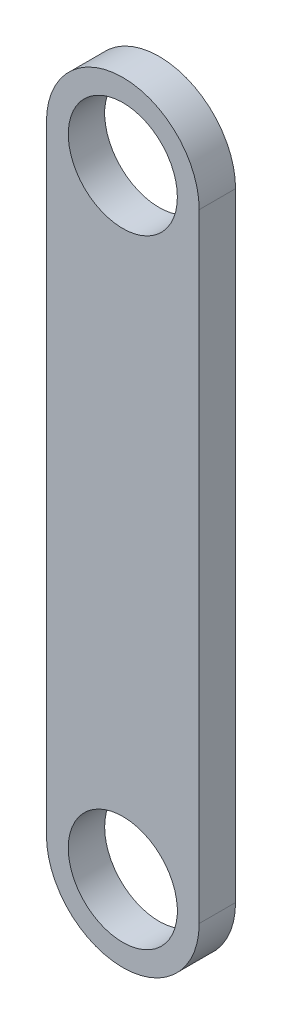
ISO-10303-21;
HEADER;
FILE_DESCRIPTION(('STEP AP214'),'2;1');
FILE_NAME('part.step','',(''),(''),'','','');
FILE_SCHEMA(('AUTOMOTIVE_DESIGN { 1 0 10303 214 1 1 1 1 }'));
ENDSEC;
DATA;
#1=APPLICATION_CONTEXT('core data for automotive mechanical design processes');
#2=APPLICATION_PROTOCOL_DEFINITION('international standard','automotive_design',2000,#1);
#3=PRODUCT_CONTEXT('',#1,'mechanical');
#4=PRODUCT('Part','Part','',(#3));
#5=PRODUCT_RELATED_PRODUCT_CATEGORY('part','',(#4));
#6=PRODUCT_DEFINITION_FORMATION('','',#4);
#7=PRODUCT_DEFINITION_CONTEXT('part definition',#1,'design');
#8=PRODUCT_DEFINITION('design','',#6,#7);
#9=PRODUCT_DEFINITION_SHAPE('','',#8);
#10=(LENGTH_UNIT() NAMED_UNIT(*) SI_UNIT(.MILLI.,.METRE.));
#11=(NAMED_UNIT(*) PLANE_ANGLE_UNIT() SI_UNIT($,.RADIAN.));
#12=(NAMED_UNIT(*) SI_UNIT($,.STERADIAN.) SOLID_ANGLE_UNIT());
#13=UNCERTAINTY_MEASURE_WITH_UNIT(LENGTH_MEASURE(1.E-05),#10,'distance_accuracy_value','');
#14=(GEOMETRIC_REPRESENTATION_CONTEXT(3) GLOBAL_UNCERTAINTY_ASSIGNED_CONTEXT((#13)) GLOBAL_UNIT_ASSIGNED_CONTEXT((#10,
#11,#12)) REPRESENTATION_CONTEXT('',''));
#15=CARTESIAN_POINT('',(0.,0.,0.));
#16=DIRECTION('',(0.,0.,1.));
#17=DIRECTION('',(1.,0.,0.));
#18=AXIS2_PLACEMENT_3D('',#15,#16,#17);
#19=CARTESIAN_POINT('',(0.,42.5,-5.));
#20=DIRECTION('',(0.,0.,1.));
#21=DIRECTION('',(1.,0.,0.));
#22=AXIS2_PLACEMENT_3D('',#19,#20,#21);
#23=CYLINDRICAL_SURFACE('',#22,10.5);
#24=CARTESIAN_POINT('',(0.,42.5,0.));
#25=DIRECTION('',(0.,0.,1.));
#26=DIRECTION('',(1.,0.,0.));
#27=AXIS2_PLACEMENT_3D('',#24,#25,#26);
#28=CIRCLE('',#27,10.5);
#29=CARTESIAN_POINT('',(10.5,42.5,0.));
#30=VERTEX_POINT('',#29);
#31=CARTESIAN_POINT('',(-10.5,42.5,0.));
#32=VERTEX_POINT('',#31);
#33=EDGE_CURVE('E98',#30,#32,#28,.T.);
#34=ORIENTED_EDGE('',*,*,#33,.F.);
#35=DIRECTION('',(0.,0.,1.));
#36=VECTOR('',#35,1.);
#37=CARTESIAN_POINT('',(10.5,42.5,-5.));
#38=LINE('',#37,#36);
#39=CARTESIAN_POINT('',(10.5,42.5,-5.));
#40=VERTEX_POINT('',#39);
#41=EDGE_CURVE('E11',#40,#30,#38,.T.);
#42=ORIENTED_EDGE('',*,*,#41,.F.);
#43=CARTESIAN_POINT('',(0.,42.5,-5.));
#44=DIRECTION('',(0.,0.,1.));
#45=DIRECTION('',(1.,0.,0.));
#46=AXIS2_PLACEMENT_3D('',#43,#44,#45);
#47=CIRCLE('',#46,10.5);
#48=CARTESIAN_POINT('',(-10.5,42.5,-5.));
#49=VERTEX_POINT('',#48);
#50=EDGE_CURVE('E91',#40,#49,#47,.T.);
#51=ORIENTED_EDGE('',*,*,#50,.T.);
#52=DIRECTION('',(0.,0.,1.));
#53=VECTOR('',#52,1.);
#54=CARTESIAN_POINT('',(-10.5,42.5,-5.));
#55=LINE('',#54,#53);
#56=EDGE_CURVE('E36',#49,#32,#55,.T.);
#57=ORIENTED_EDGE('',*,*,#56,.T.);
#58=EDGE_LOOP('',(#34,#42,#51,#57));
#59=FACE_BOUND('',#58,.T.);
#60=ADVANCED_FACE('F33',(#59),#23,.T.);
#61=CARTESIAN_POINT('',(10.5,42.5,-5.));
#62=DIRECTION('',(1.,0.,0.));
#63=DIRECTION('',(0.,1.,0.));
#64=AXIS2_PLACEMENT_3D('',#61,#62,#63);
#65=PLANE('',#64);
#66=DIRECTION('',(0.,1.,0.));
#67=VECTOR('',#66,1.);
#68=CARTESIAN_POINT('',(10.5,42.5,0.));
#69=LINE('',#68,#67);
#70=CARTESIAN_POINT('',(10.5,-42.5,0.));
#71=VERTEX_POINT('',#70);
#72=EDGE_CURVE('E93',#71,#30,#69,.T.);
#73=ORIENTED_EDGE('',*,*,#72,.F.);
#74=DIRECTION('',(0.,0.,1.));
#75=VECTOR('',#74,1.);
#76=CARTESIAN_POINT('',(10.5,-42.5,-5.));
#77=LINE('',#76,#75);
#78=CARTESIAN_POINT('',(10.5,-42.5,-5.));
#79=VERTEX_POINT('',#78);
#80=EDGE_CURVE('E42',#79,#71,#77,.T.);
#81=ORIENTED_EDGE('',*,*,#80,.F.);
#82=DIRECTION('',(0.,1.,0.));
#83=VECTOR('',#82,1.);
#84=CARTESIAN_POINT('',(10.5,42.5,-5.));
#85=LINE('',#84,#83);
#86=EDGE_CURVE('E88',#79,#40,#85,.T.);
#87=ORIENTED_EDGE('',*,*,#86,.T.);
#88=ORIENTED_EDGE('',*,*,#41,.T.);
#89=EDGE_LOOP('',(#73,#81,#87,#88));
#90=FACE_BOUND('',#89,.T.);
#91=ADVANCED_FACE('F109',(#90),#65,.T.);
#92=CARTESIAN_POINT('',(0.,-42.5,-5.));
#93=DIRECTION('',(0.,0.,1.));
#94=DIRECTION('',(1.,0.,0.));
#95=AXIS2_PLACEMENT_3D('',#92,#93,#94);
#96=CYLINDRICAL_SURFACE('',#95,10.5);
#97=CARTESIAN_POINT('',(0.,-42.5,0.));
#98=DIRECTION('',(0.,0.,1.));
#99=DIRECTION('',(-1.,0.,0.));
#100=AXIS2_PLACEMENT_3D('',#97,#98,#99);
#101=CIRCLE('',#100,10.5);
#102=CARTESIAN_POINT('',(-10.5,-42.5,0.));
#103=VERTEX_POINT('',#102);
#104=EDGE_CURVE('E83',#103,#71,#101,.T.);
#105=ORIENTED_EDGE('',*,*,#104,.F.);
#106=DIRECTION('',(0.,0.,1.));
#107=VECTOR('',#106,1.);
#108=CARTESIAN_POINT('',(-10.5,-42.5,-5.));
#109=LINE('',#108,#107);
#110=CARTESIAN_POINT('',(-10.5,-42.5,-5.));
#111=VERTEX_POINT('',#110);
#112=EDGE_CURVE('E78',#111,#103,#109,.T.);
#113=ORIENTED_EDGE('',*,*,#112,.F.);
#114=CARTESIAN_POINT('',(0.,-42.5,-5.));
#115=DIRECTION('',(0.,0.,1.));
#116=DIRECTION('',(-1.,0.,0.));
#117=AXIS2_PLACEMENT_3D('',#114,#115,#116);
#118=CIRCLE('',#117,10.5);
#119=EDGE_CURVE('E81',#111,#79,#118,.T.);
#120=ORIENTED_EDGE('',*,*,#119,.T.);
#121=ORIENTED_EDGE('',*,*,#80,.T.);
#122=EDGE_LOOP('',(#105,#113,#120,#121));
#123=FACE_BOUND('',#122,.T.);
#124=ADVANCED_FACE('F80',(#123),#96,.T.);
#125=CARTESIAN_POINT('',(-10.5,42.5,-5.));
#126=DIRECTION('',(-1.,0.,0.));
#127=DIRECTION('',(0.,-1.,0.));
#128=AXIS2_PLACEMENT_3D('',#125,#126,#127);
#129=PLANE('',#128);
#130=DIRECTION('',(0.,-1.,0.));
#131=VECTOR('',#130,1.);
#132=CARTESIAN_POINT('',(-10.5,42.5,0.));
#133=LINE('',#132,#131);
#134=EDGE_CURVE('E101',#32,#103,#133,.T.);
#135=ORIENTED_EDGE('',*,*,#134,.F.);
#136=ORIENTED_EDGE('',*,*,#56,.F.);
#137=DIRECTION('',(0.,-1.,0.));
#138=VECTOR('',#137,1.);
#139=CARTESIAN_POINT('',(-10.5,42.5,-5.));
#140=LINE('',#139,#138);
#141=EDGE_CURVE('E87',#49,#111,#140,.T.);
#142=ORIENTED_EDGE('',*,*,#141,.T.);
#143=ORIENTED_EDGE('',*,*,#112,.T.);
#144=EDGE_LOOP('',(#135,#136,#142,#143));
#145=FACE_BOUND('',#144,.T.);
#146=ADVANCED_FACE('F90',(#145),#129,.T.);
#147=CARTESIAN_POINT('',(0.,42.5,-5.));
#148=DIRECTION('',(0.,0.,1.));
#149=DIRECTION('',(1.,0.,0.));
#150=AXIS2_PLACEMENT_3D('',#147,#148,#149);
#151=PLANE('',#150);
#152=CARTESIAN_POINT('',(0.,-42.5,-5.));
#153=DIRECTION('',(0.,0.,1.));
#154=DIRECTION('',(-1.,0.,0.));
#155=AXIS2_PLACEMENT_3D('',#152,#153,#154);
#156=CIRCLE('',#155,7.5);
#157=CARTESIAN_POINT('',(-7.49999999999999,-42.5,-5.));
#158=VERTEX_POINT('',#157);
#159=EDGE_CURVE('E142',#158,#158,#156,.T.);
#160=ORIENTED_EDGE('',*,*,#159,.T.);
#161=EDGE_LOOP('',(#160));
#162=FACE_BOUND('',#161,.T.);
#163=CARTESIAN_POINT('',(0.,42.5,-5.));
#164=DIRECTION('',(0.,0.,1.));
#165=DIRECTION('',(1.,0.,0.));
#166=AXIS2_PLACEMENT_3D('',#163,#164,#165);
#167=CIRCLE('',#166,7.5);
#168=CARTESIAN_POINT('',(7.5,42.5,-5.));
#169=VERTEX_POINT('',#168);
#170=EDGE_CURVE('E102',#169,#169,#167,.T.);
#171=ORIENTED_EDGE('',*,*,#170,.T.);
#172=EDGE_LOOP('',(#171));
#173=FACE_BOUND('',#172,.T.);
#174=ORIENTED_EDGE('',*,*,#50,.F.);
#175=ORIENTED_EDGE('',*,*,#86,.F.);
#176=ORIENTED_EDGE('',*,*,#119,.F.);
#177=ORIENTED_EDGE('',*,*,#141,.F.);
#178=EDGE_LOOP('',(#174,#175,#176,#177));
#179=FACE_BOUND('',#178,.T.);
#180=ADVANCED_FACE('F86',(#162,#173,#179),#151,.F.);
#181=CARTESIAN_POINT('',(0.,42.5,0.));
#182=DIRECTION('',(0.,0.,1.));
#183=DIRECTION('',(1.,0.,0.));
#184=AXIS2_PLACEMENT_3D('',#181,#182,#183);
#185=PLANE('',#184);
#186=CARTESIAN_POINT('',(0.,-42.5,0.));
#187=DIRECTION('',(0.,0.,1.));
#188=DIRECTION('',(-1.,0.,0.));
#189=AXIS2_PLACEMENT_3D('',#186,#187,#188);
#190=CIRCLE('',#189,7.5);
#191=CARTESIAN_POINT('',(-7.49999999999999,-42.5,0.));
#192=VERTEX_POINT('',#191);
#193=EDGE_CURVE('E145',#192,#192,#190,.T.);
#194=ORIENTED_EDGE('',*,*,#193,.F.);
#195=EDGE_LOOP('',(#194));
#196=FACE_BOUND('',#195,.T.);
#197=CARTESIAN_POINT('',(0.,42.5,0.));
#198=DIRECTION('',(0.,0.,1.));
#199=DIRECTION('',(1.,0.,0.));
#200=AXIS2_PLACEMENT_3D('',#197,#198,#199);
#201=CIRCLE('',#200,7.5);
#202=CARTESIAN_POINT('',(7.5,42.5,0.));
#203=VERTEX_POINT('',#202);
#204=EDGE_CURVE('E147',#203,#203,#201,.T.);
#205=ORIENTED_EDGE('',*,*,#204,.F.);
#206=EDGE_LOOP('',(#205));
#207=FACE_BOUND('',#206,.T.);
#208=ORIENTED_EDGE('',*,*,#33,.T.);
#209=ORIENTED_EDGE('',*,*,#134,.T.);
#210=ORIENTED_EDGE('',*,*,#104,.T.);
#211=ORIENTED_EDGE('',*,*,#72,.T.);
#212=EDGE_LOOP('',(#208,#209,#210,#211));
#213=FACE_BOUND('',#212,.T.);
#214=ADVANCED_FACE('F108',(#196,#207,#213),#185,.T.);
#215=CARTESIAN_POINT('',(0.,42.5,-5.));
#216=DIRECTION('',(0.,0.,1.));
#217=DIRECTION('',(1.,0.,0.));
#218=AXIS2_PLACEMENT_3D('',#215,#216,#217);
#219=CYLINDRICAL_SURFACE('',#218,7.5);
#220=ORIENTED_EDGE('',*,*,#170,.F.);
#221=EDGE_LOOP('',(#220));
#222=FACE_BOUND('',#221,.T.);
#223=ORIENTED_EDGE('',*,*,#204,.T.);
#224=EDGE_LOOP('',(#223));
#225=FACE_BOUND('',#224,.T.);
#226=ADVANCED_FACE('F127',(#222,#225),#219,.F.);
#227=CARTESIAN_POINT('',(0.,-42.5,-5.));
#228=DIRECTION('',(0.,0.,1.));
#229=DIRECTION('',(1.,0.,0.));
#230=AXIS2_PLACEMENT_3D('',#227,#228,#229);
#231=CYLINDRICAL_SURFACE('',#230,7.5);
#232=ORIENTED_EDGE('',*,*,#159,.F.);
#233=EDGE_LOOP('',(#232));
#234=FACE_BOUND('',#233,.T.);
#235=ORIENTED_EDGE('',*,*,#193,.T.);
#236=EDGE_LOOP('',(#235));
#237=FACE_BOUND('',#236,.T.);
#238=ADVANCED_FACE('F134',(#234,#237),#231,.F.);
#239=CLOSED_SHELL('',(#60,#91,#124,#146,#180,#214,#226,#238));
#240=MANIFOLD_SOLID_BREP('B2',#239);
#241=ADVANCED_BREP_SHAPE_REPRESENTATION('',(#18,#240),#14);
#242=SHAPE_DEFINITION_REPRESENTATION(#9,#241);
ENDSEC;
END-ISO-10303-21;
